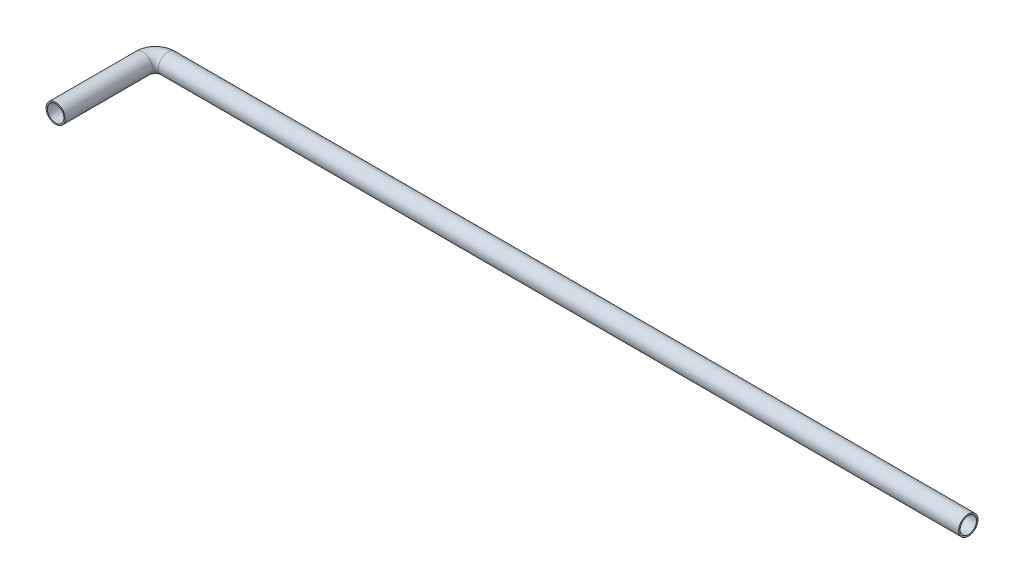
from build123d import *

# Parameters (mm, degrees)
SCHIZZO1_R                   = 5.5
SCHIZZO1_R_2                 = 4.75
ESTRUSIONE_ESTRUSIONE1_DEPTH = 50
SCHIZZO2_R                   = 5.5
SCHIZZO2_R_2                 = 4.75
RIVOLUZIONE2_ANGLE           = 90
SCHIZZO3_R                   = 5.541847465
SCHIZZO3_R_2                 = 4.708152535
ESTRUSIONE_ESTRUSIONE2_DEPTH = 459


with BuildPart() as part:
    # Schizzo1 → Estrusione-Estrusione1 (new body)
    with BuildSketch(Plane.XY):
        Circle(SCHIZZO1_R)
        Circle(SCHIZZO1_R_2, mode=Mode.SUBTRACT)
    extrude(amount=ESTRUSIONE_ESTRUSIONE1_DEPTH)

    # Schizzo2 → Rivoluzione2 (revolve)
    with BuildSketch(Plane(origin=(0, 0, 0), x_dir=(-1, 0, 0), z_dir=(0, 0, -1))):
        Circle(SCHIZZO2_R)
        Circle(SCHIZZO2_R_2, mode=Mode.SUBTRACT)
    revolve(axis=Axis((7.258775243, 7.028281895, 0), (0, -1, 0)), revolution_arc=RIVOLUZIONE2_ANGLE)

    # Schizzo3 → Estrusione-Estrusione2 (add)
    with BuildSketch(Plane(origin=(7.258775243, 0, 0), x_dir=(0, 0, -1), z_dir=(1, 0, 0))):
        with Locations((7.216927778, 0)):
            Circle(SCHIZZO3_R)
        with Locations(Location((7.216927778, 0, 0), (0, 0, 179.996021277))):
            Circle(SCHIZZO3_R_2, mode=Mode.SUBTRACT)
    extrude(amount=ESTRUSIONE_ESTRUSIONE2_DEPTH)


solid = part.part
